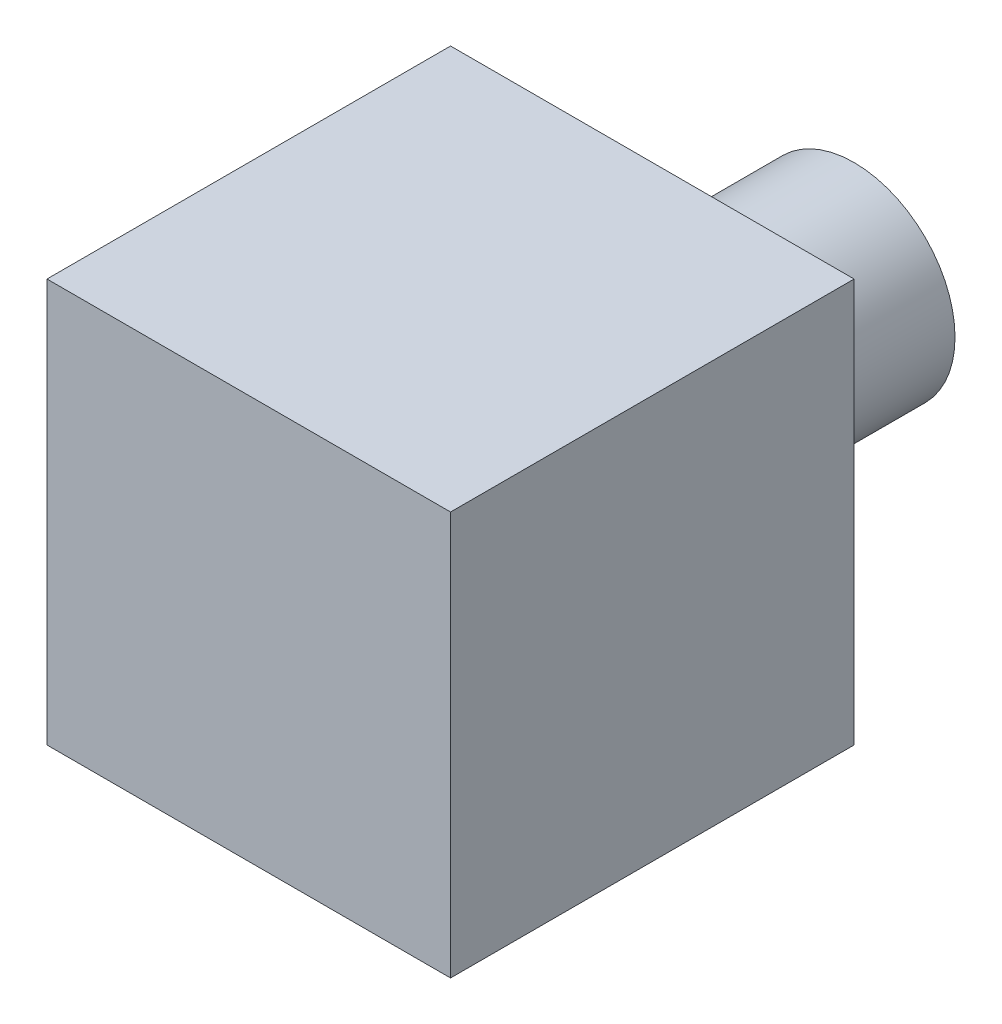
from build123d import *

# Parameters (mm, degrees)
ESQUISSE1_W        = 20
ESQUISSE1_H        = 20
BOSS_EXTRU_1_DEPTH = 20
ESQUISSE2_R        = 5
BOSS_EXTRU_2_DEPTH = 10


with BuildPart() as part:
    # Esquisse1 → Boss.-Extru.1 (new body)
    with BuildSketch(Plane.XY):
        Rectangle(ESQUISSE1_W, ESQUISSE1_H)
    extrude(amount=BOSS_EXTRU_1_DEPTH)

    # Esquisse2 → Boss.-Extru.2 (add)
    with BuildSketch(Plane(origin=(0, 0, 0), x_dir=(-1, 0, 0), z_dir=(0, 0, -1))):
        with Locations(Location((0, 0, 0), (0, 0, 180))):
            Circle(ESQUISSE2_R)
    extrude(amount=BOSS_EXTRU_2_DEPTH)


solid = part.part
